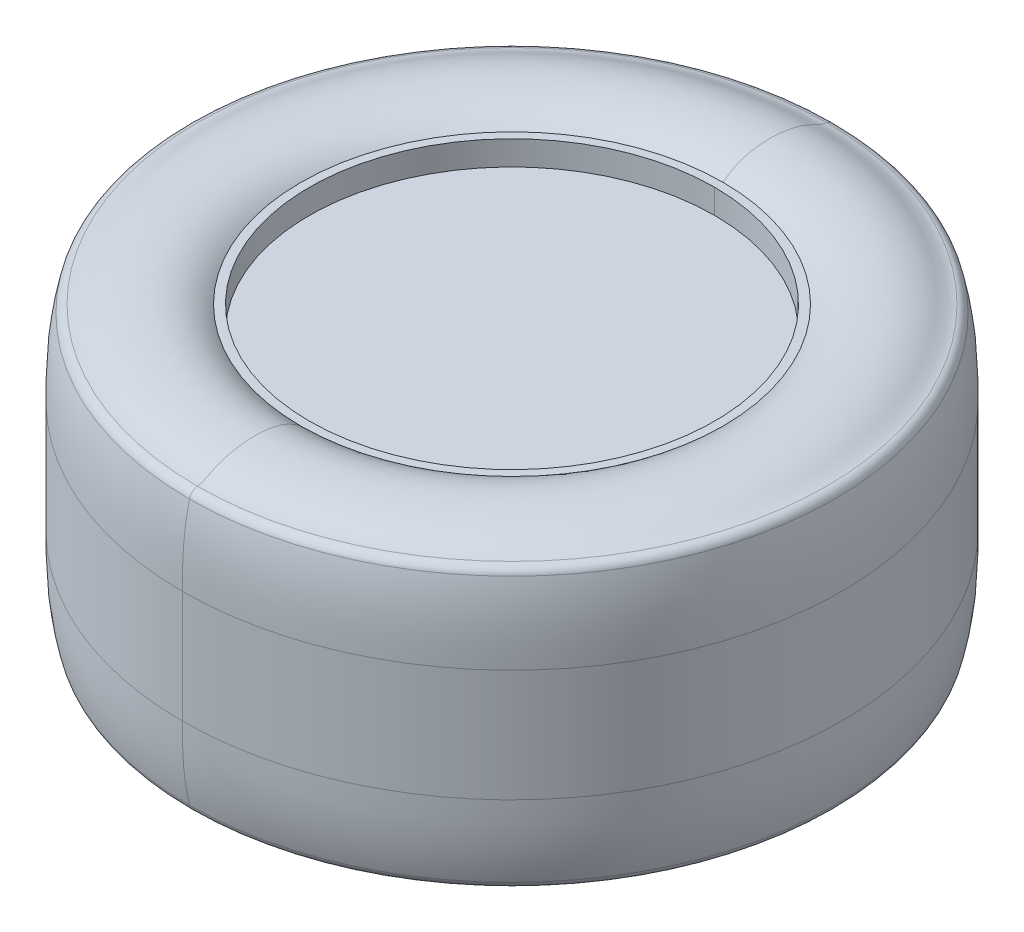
ISO-10303-21;
HEADER;
FILE_DESCRIPTION(('STEP AP214'),'2;1');
FILE_NAME('part.step','',(''),(''),'','','');
FILE_SCHEMA(('AUTOMOTIVE_DESIGN { 1 0 10303 214 1 1 1 1 }'));
ENDSEC;
DATA;
#1=APPLICATION_CONTEXT('core data for automotive mechanical design processes');
#2=APPLICATION_PROTOCOL_DEFINITION('international standard','automotive_design',2000,#1);
#3=PRODUCT_CONTEXT('',#1,'mechanical');
#4=PRODUCT('Part','Part','',(#3));
#5=PRODUCT_RELATED_PRODUCT_CATEGORY('part','',(#4));
#6=PRODUCT_DEFINITION_FORMATION('','',#4);
#7=PRODUCT_DEFINITION_CONTEXT('part definition',#1,'design');
#8=PRODUCT_DEFINITION('design','',#6,#7);
#9=PRODUCT_DEFINITION_SHAPE('','',#8);
#10=(LENGTH_UNIT() NAMED_UNIT(*) SI_UNIT(.MILLI.,.METRE.));
#11=(NAMED_UNIT(*) PLANE_ANGLE_UNIT() SI_UNIT($,.RADIAN.));
#12=(NAMED_UNIT(*) SI_UNIT($,.STERADIAN.) SOLID_ANGLE_UNIT());
#13=UNCERTAINTY_MEASURE_WITH_UNIT(LENGTH_MEASURE(1.E-05),#10,'distance_accuracy_value','');
#14=(GEOMETRIC_REPRESENTATION_CONTEXT(3) GLOBAL_UNCERTAINTY_ASSIGNED_CONTEXT((#13)) GLOBAL_UNIT_ASSIGNED_CONTEXT((#10,
#11,#12)) REPRESENTATION_CONTEXT('',''));
#15=CARTESIAN_POINT('',(0.,0.,0.));
#16=DIRECTION('',(0.,0.,1.));
#17=DIRECTION('',(1.,0.,0.));
#18=AXIS2_PLACEMENT_3D('',#15,#16,#17);
#19=CARTESIAN_POINT('',(0.,-790.,-50.));
#20=CARTESIAN_POINT('',(0.,-765.6190547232,-50.));
#21=CARTESIAN_POINT('',(0.,-741.2539641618,-50.));
#22=CARTESIAN_POINT('',(0.,-711.7224839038,-42.79019819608));
#23=(BOUNDED_CURVE() B_SPLINE_CURVE(3,(#19,#20,#21,#22),.UNSPECIFIED.,.F.,
.F.) B_SPLINE_CURVE_WITH_KNOTS((4,4),(0.,1.),
.UNSPECIFIED.) CURVE() GEOMETRIC_REPRESENTATION_ITEM() RATIONAL_B_SPLINE_CURVE((1.,1.,1.,1.)) REPRESENTATION_ITEM(''));
#24=CARTESIAN_POINT('',(0.,-790.,287.5));
#25=DIRECTION('',(0.,-1.,0.));
#26=AXIS1_PLACEMENT('',#24,#25);
#27=SURFACE_OF_REVOLUTION('',#23,#26);
#28=CARTESIAN_POINT('',(0.,-711.7224839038,-42.79019819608));
#29=CARTESIAN_POINT('',(0.,-741.2539641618,-50.));
#30=CARTESIAN_POINT('',(0.,-765.6190547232,-50.));
#31=CARTESIAN_POINT('',(0.,-790.,-50.));
#32=(BOUNDED_CURVE() B_SPLINE_CURVE(3,(#28,#29,#30,#31),.UNSPECIFIED.,.F.,
.F.) B_SPLINE_CURVE_WITH_KNOTS((4,4),(-1.,0.),
.UNSPECIFIED.) CURVE() GEOMETRIC_REPRESENTATION_ITEM() RATIONAL_B_SPLINE_CURVE((1.,1.,1.,1.)) REPRESENTATION_ITEM(''));
#33=CARTESIAN_POINT('',(0.,-711.7224839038,-42.79019819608));
#34=VERTEX_POINT('',#33);
#35=CARTESIAN_POINT('',(0.,-790.,-50.));
#36=VERTEX_POINT('',#35);
#37=EDGE_CURVE('E43',#34,#36,#32,.T.);
#38=ORIENTED_EDGE('',*,*,#37,.F.);
#39=CARTESIAN_POINT('',(0.,-711.7224839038,287.5));
#40=DIRECTION('',(0.,1.,0.));
#41=DIRECTION('',(0.,0.,-1.));
#42=AXIS2_PLACEMENT_3D('',#39,#40,#41);
#43=CIRCLE('',#42,330.29019819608);
#44=CARTESIAN_POINT('',(0.,-711.7224839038,617.79019819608));
#45=VERTEX_POINT('',#44);
#46=EDGE_CURVE('E158',#45,#34,#43,.T.);
#47=ORIENTED_EDGE('',*,*,#46,.F.);
#48=CARTESIAN_POINT('',(0.,-711.7224839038,617.79019819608));
#49=CARTESIAN_POINT('',(0.,-741.2539641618,625.));
#50=CARTESIAN_POINT('',(0.,-765.6190547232,625.));
#51=CARTESIAN_POINT('',(0.,-790.,625.));
#52=(BOUNDED_CURVE() B_SPLINE_CURVE(3,(#48,#49,#50,#51),.UNSPECIFIED.,.F.,
.F.) B_SPLINE_CURVE_WITH_KNOTS((4,4),(-1.,0.),
.UNSPECIFIED.) CURVE() GEOMETRIC_REPRESENTATION_ITEM() RATIONAL_B_SPLINE_CURVE((1.,1.,1.,1.)) REPRESENTATION_ITEM(''));
#53=CARTESIAN_POINT('',(0.,-790.,625.));
#54=VERTEX_POINT('',#53);
#55=EDGE_CURVE('E11',#45,#54,#52,.T.);
#56=ORIENTED_EDGE('',*,*,#55,.T.);
#57=CARTESIAN_POINT('',(0.,-790.,287.5));
#58=DIRECTION('',(0.,1.,0.));
#59=DIRECTION('',(0.,0.,-1.));
#60=AXIS2_PLACEMENT_3D('',#57,#58,#59);
#61=CIRCLE('',#60,337.5);
#62=EDGE_CURVE('E29',#54,#36,#61,.T.);
#63=ORIENTED_EDGE('',*,*,#62,.T.);
#64=EDGE_LOOP('',(#38,#47,#56,#63));
#65=FACE_BOUND('',#64,.T.);
#66=ADVANCED_FACE('F16',(#65),#27,.F.);
#67=CARTESIAN_POINT('',(0.,-704.2386406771,-34.76891355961));
#68=CARTESIAN_POINT('',(0.,-703.3635739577,-29.67599466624));
#69=CARTESIAN_POINT('',(0.,-700.9960068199,-23.94984631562));
#70=CARTESIAN_POINT('',(0.,-696.9334367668,-17.87878802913));
#71=CARTESIAN_POINT('',(0.,-691.2308892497,-8.378636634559));
#72=CARTESIAN_POINT('',(0.,-686.4900912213,10.766149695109));
#73=CARTESIAN_POINT('',(0.,-686.736889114,36.802176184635));
#74=CARTESIAN_POINT('',(0.,-693.463984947,58.611324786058));
#75=CARTESIAN_POINT('',(0.,-703.9999999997,71.320372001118));
#76=(BOUNDED_CURVE() B_SPLINE_CURVE(7,(#67,#68,#69,#70,#71,#72,#73,#74,#75),.UNSPECIFIED.,.F.,
.F.) B_SPLINE_CURVE_WITH_KNOTS((8,1,8),(0.,0.467340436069,1.),
.UNSPECIFIED.) CURVE() GEOMETRIC_REPRESENTATION_ITEM() RATIONAL_B_SPLINE_CURVE((1.,1.,1.,1.,1.,
1.,1.,1.,1.)) REPRESENTATION_ITEM(''));
#77=CARTESIAN_POINT('',(0.,-704.2386406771,287.5));
#78=DIRECTION('',(0.,-1.,0.));
#79=AXIS1_PLACEMENT('',#77,#78);
#80=SURFACE_OF_REVOLUTION('',#76,#79);
#81=CARTESIAN_POINT('',(0.,-703.9999999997,71.320372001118));
#82=CARTESIAN_POINT('',(0.,-693.463984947,58.611324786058));
#83=CARTESIAN_POINT('',(0.,-686.736889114,36.802176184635));
#84=CARTESIAN_POINT('',(0.,-686.4900912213,10.766149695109));
#85=CARTESIAN_POINT('',(0.,-691.2308892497,-8.378636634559));
#86=CARTESIAN_POINT('',(0.,-696.9334367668,-17.87878802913));
#87=CARTESIAN_POINT('',(0.,-700.9960068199,-23.94984631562));
#88=CARTESIAN_POINT('',(0.,-703.3635739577,-29.67599466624));
#89=CARTESIAN_POINT('',(0.,-704.2386406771,-34.76891355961));
#90=(BOUNDED_CURVE() B_SPLINE_CURVE(7,(#81,#82,#83,#84,#85,#86,#87,#88,#89),.UNSPECIFIED.,.F.,
.F.) B_SPLINE_CURVE_WITH_KNOTS((8,1,8),(-1.,-0.467340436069,0.),
.UNSPECIFIED.) CURVE() GEOMETRIC_REPRESENTATION_ITEM() RATIONAL_B_SPLINE_CURVE((1.,1.,1.,1.,1.,
1.,1.,1.,1.)) REPRESENTATION_ITEM(''));
#91=CARTESIAN_POINT('',(0.,-703.9999999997,71.32037200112));
#92=VERTEX_POINT('',#91);
#93=CARTESIAN_POINT('',(0.,-704.2386406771,-34.76891355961));
#94=VERTEX_POINT('',#93);
#95=EDGE_CURVE('E237',#92,#94,#90,.T.);
#96=ORIENTED_EDGE('',*,*,#95,.F.);
#97=CARTESIAN_POINT('',(0.,-703.9999999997,287.5));
#98=DIRECTION('',(0.,1.,0.));
#99=DIRECTION('',(0.,0.,-1.));
#100=AXIS2_PLACEMENT_3D('',#97,#98,#99);
#101=CIRCLE('',#100,216.17962799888);
#102=CARTESIAN_POINT('',(0.,-703.9999999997,503.679627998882));
#103=VERTEX_POINT('',#102);
#104=EDGE_CURVE('E246',#103,#92,#101,.T.);
#105=ORIENTED_EDGE('',*,*,#104,.F.);
#106=CARTESIAN_POINT('',(0.,-703.9999999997,503.679627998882));
#107=CARTESIAN_POINT('',(0.,-693.463984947,516.388675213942));
#108=CARTESIAN_POINT('',(0.,-686.736889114,538.197823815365));
#109=CARTESIAN_POINT('',(0.,-686.4900912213,564.233850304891));
#110=CARTESIAN_POINT('',(0.,-691.2308892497,583.378636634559));
#111=CARTESIAN_POINT('',(0.,-696.9334367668,592.87878802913));
#112=CARTESIAN_POINT('',(0.,-700.9960068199,598.94984631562));
#113=CARTESIAN_POINT('',(0.,-703.3635739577,604.67599466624));
#114=CARTESIAN_POINT('',(0.,-704.2386406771,609.76891355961));
#115=(BOUNDED_CURVE() B_SPLINE_CURVE(7,(#106,#107,#108,#109,#110,#111,#112,#113,#114),
.UNSPECIFIED.,.F.,.F.) B_SPLINE_CURVE_WITH_KNOTS((8,1,8),(-1.,-0.467340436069,0.),
.UNSPECIFIED.) CURVE() GEOMETRIC_REPRESENTATION_ITEM() RATIONAL_B_SPLINE_CURVE((1.,1.,1.,1.,1.,
1.,1.,1.,1.)) REPRESENTATION_ITEM(''));
#116=CARTESIAN_POINT('',(0.,-704.2386406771,609.76891355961));
#117=VERTEX_POINT('',#116);
#118=EDGE_CURVE('E217',#103,#117,#115,.T.);
#119=ORIENTED_EDGE('',*,*,#118,.T.);
#120=CARTESIAN_POINT('',(0.,-704.2386406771,287.5));
#121=DIRECTION('',(0.,1.,0.));
#122=DIRECTION('',(0.,0.,-1.));
#123=AXIS2_PLACEMENT_3D('',#120,#121,#122);
#124=CIRCLE('',#123,322.26891355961);
#125=EDGE_CURVE('E207',#117,#94,#124,.T.);
#126=ORIENTED_EDGE('',*,*,#125,.T.);
#127=EDGE_LOOP('',(#96,#105,#119,#126));
#128=FACE_BOUND('',#127,.T.);
#129=ADVANCED_FACE('F322',(#128),#80,.F.);
#130=CARTESIAN_POINT('',(0.,-905.,-50.));
#131=CARTESIAN_POINT('',(0.,-929.3809452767,-50.));
#132=CARTESIAN_POINT('',(0.,-953.7460358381,-50.));
#133=CARTESIAN_POINT('',(0.,-983.2775160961,-42.79019819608));
#134=(BOUNDED_CURVE() B_SPLINE_CURVE(3,(#130,#131,#132,#133),.UNSPECIFIED.,.F.,
.F.) B_SPLINE_CURVE_WITH_KNOTS((4,4),(0.,1.),
.UNSPECIFIED.) CURVE() GEOMETRIC_REPRESENTATION_ITEM() RATIONAL_B_SPLINE_CURVE((1.,1.,1.,1.)) REPRESENTATION_ITEM(''));
#135=CARTESIAN_POINT('',(0.,-905.,287.5));
#136=DIRECTION('',(0.,1.,0.));
#137=AXIS1_PLACEMENT('',#135,#136);
#138=SURFACE_OF_REVOLUTION('',#134,#137);
#139=CARTESIAN_POINT('',(0.,-983.2775160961,-42.79019819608));
#140=CARTESIAN_POINT('',(0.,-953.7460358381,-50.));
#141=CARTESIAN_POINT('',(0.,-929.3809452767,-50.));
#142=CARTESIAN_POINT('',(0.,-905.,-50.));
#143=(BOUNDED_CURVE() B_SPLINE_CURVE(3,(#139,#140,#141,#142),.UNSPECIFIED.,.F.,
.F.) B_SPLINE_CURVE_WITH_KNOTS((4,4),(-1.,0.),
.UNSPECIFIED.) CURVE() GEOMETRIC_REPRESENTATION_ITEM() RATIONAL_B_SPLINE_CURVE((1.,1.,1.,1.)) REPRESENTATION_ITEM(''));
#144=CARTESIAN_POINT('',(0.,-983.2775160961,-42.79019819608));
#145=VERTEX_POINT('',#144);
#146=CARTESIAN_POINT('',(0.,-905.,-50.));
#147=VERTEX_POINT('',#146);
#148=EDGE_CURVE('E254',#145,#147,#143,.T.);
#149=ORIENTED_EDGE('',*,*,#148,.F.);
#150=CARTESIAN_POINT('',(0.,-983.2775160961,287.5));
#151=DIRECTION('',(0.,-1.,0.));
#152=DIRECTION('',(0.,0.,-1.));
#153=AXIS2_PLACEMENT_3D('',#150,#151,#152);
#154=CIRCLE('',#153,330.29019819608);
#155=CARTESIAN_POINT('',(0.,-983.2775160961,617.79019819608));
#156=VERTEX_POINT('',#155);
#157=EDGE_CURVE('E196',#156,#145,#154,.T.);
#158=ORIENTED_EDGE('',*,*,#157,.F.);
#159=CARTESIAN_POINT('',(0.,-983.2775160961,617.79019819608));
#160=CARTESIAN_POINT('',(0.,-953.7460358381,625.));
#161=CARTESIAN_POINT('',(0.,-929.3809452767,625.));
#162=CARTESIAN_POINT('',(0.,-905.,625.));
#163=(BOUNDED_CURVE() B_SPLINE_CURVE(3,(#159,#160,#161,#162),.UNSPECIFIED.,.F.,
.F.) B_SPLINE_CURVE_WITH_KNOTS((4,4),(-1.,0.),
.UNSPECIFIED.) CURVE() GEOMETRIC_REPRESENTATION_ITEM() RATIONAL_B_SPLINE_CURVE((1.,1.,1.,1.)) REPRESENTATION_ITEM(''));
#164=CARTESIAN_POINT('',(0.,-905.,625.));
#165=VERTEX_POINT('',#164);
#166=EDGE_CURVE('E201',#156,#165,#163,.T.);
#167=ORIENTED_EDGE('',*,*,#166,.T.);
#168=CARTESIAN_POINT('',(0.,-905.,287.5));
#169=DIRECTION('',(0.,-1.,0.));
#170=DIRECTION('',(0.,0.,-1.));
#171=AXIS2_PLACEMENT_3D('',#168,#169,#170);
#172=CIRCLE('',#171,337.5);
#173=EDGE_CURVE('E167',#165,#147,#172,.T.);
#174=ORIENTED_EDGE('',*,*,#173,.T.);
#175=EDGE_LOOP('',(#149,#158,#167,#174));
#176=FACE_BOUND('',#175,.T.);
#177=ADVANCED_FACE('F327',(#176),#138,.F.);
#178=CARTESIAN_POINT('',(0.,-990.7613593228,-34.76891355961));
#179=CARTESIAN_POINT('',(0.,-991.6364260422,-29.67599466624));
#180=CARTESIAN_POINT('',(0.,-994.00399318,-23.94984631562));
#181=CARTESIAN_POINT('',(0.,-998.0665632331,-17.87878802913));
#182=CARTESIAN_POINT('',(0.,-1003.76911075,-8.378636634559));
#183=CARTESIAN_POINT('',(0.,-1008.509908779,10.766149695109));
#184=CARTESIAN_POINT('',(0.,-1008.263110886,36.802176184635));
#185=CARTESIAN_POINT('',(0.,-1001.536015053,58.611324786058));
#186=CARTESIAN_POINT('',(0.,-991.0000000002,71.320372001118));
#187=(BOUNDED_CURVE() B_SPLINE_CURVE(7,(#178,#179,#180,#181,#182,#183,#184,#185,#186),
.UNSPECIFIED.,.F.,.F.) B_SPLINE_CURVE_WITH_KNOTS((8,1,8),(0.,0.467340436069,1.),
.UNSPECIFIED.) CURVE() GEOMETRIC_REPRESENTATION_ITEM() RATIONAL_B_SPLINE_CURVE((1.,1.,1.,1.,1.,
1.,1.,1.,1.)) REPRESENTATION_ITEM(''));
#188=CARTESIAN_POINT('',(0.,-990.7613593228,287.5));
#189=DIRECTION('',(0.,1.,0.));
#190=AXIS1_PLACEMENT('',#188,#189);
#191=SURFACE_OF_REVOLUTION('',#187,#190);
#192=CARTESIAN_POINT('',(0.,-991.0000000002,71.320372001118));
#193=CARTESIAN_POINT('',(0.,-1001.536015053,58.611324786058));
#194=CARTESIAN_POINT('',(0.,-1008.263110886,36.802176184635));
#195=CARTESIAN_POINT('',(0.,-1008.509908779,10.766149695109));
#196=CARTESIAN_POINT('',(0.,-1003.76911075,-8.378636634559));
#197=CARTESIAN_POINT('',(0.,-998.0665632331,-17.87878802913));
#198=CARTESIAN_POINT('',(0.,-994.00399318,-23.94984631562));
#199=CARTESIAN_POINT('',(0.,-991.6364260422,-29.67599466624));
#200=CARTESIAN_POINT('',(0.,-990.7613593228,-34.76891355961));
#201=(BOUNDED_CURVE() B_SPLINE_CURVE(7,(#192,#193,#194,#195,#196,#197,#198,#199,#200),
.UNSPECIFIED.,.F.,.F.) B_SPLINE_CURVE_WITH_KNOTS((8,1,8),(-1.,-0.467340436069,0.),
.UNSPECIFIED.) CURVE() GEOMETRIC_REPRESENTATION_ITEM() RATIONAL_B_SPLINE_CURVE((1.,1.,1.,1.,1.,
1.,1.,1.,1.)) REPRESENTATION_ITEM(''));
#202=CARTESIAN_POINT('',(0.,-991.0000000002,71.32037200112));
#203=VERTEX_POINT('',#202);
#204=CARTESIAN_POINT('',(0.,-990.7613593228,-34.76891355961));
#205=VERTEX_POINT('',#204);
#206=EDGE_CURVE('E121',#203,#205,#201,.T.);
#207=ORIENTED_EDGE('',*,*,#206,.F.);
#208=CARTESIAN_POINT('',(0.,-991.0000000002,287.5));
#209=DIRECTION('',(0.,-1.,0.));
#210=DIRECTION('',(0.,0.,-1.));
#211=AXIS2_PLACEMENT_3D('',#208,#209,#210);
#212=CIRCLE('',#211,216.17962799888);
#213=CARTESIAN_POINT('',(0.,-991.0000000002,503.679627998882));
#214=VERTEX_POINT('',#213);
#215=EDGE_CURVE('E162',#214,#203,#212,.T.);
#216=ORIENTED_EDGE('',*,*,#215,.F.);
#217=CARTESIAN_POINT('',(0.,-991.0000000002,503.679627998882));
#218=CARTESIAN_POINT('',(0.,-1001.536015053,516.388675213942));
#219=CARTESIAN_POINT('',(0.,-1008.263110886,538.197823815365));
#220=CARTESIAN_POINT('',(0.,-1008.509908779,564.233850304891));
#221=CARTESIAN_POINT('',(0.,-1003.76911075,583.378636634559));
#222=CARTESIAN_POINT('',(0.,-998.0665632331,592.87878802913));
#223=CARTESIAN_POINT('',(0.,-994.00399318,598.94984631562));
#224=CARTESIAN_POINT('',(0.,-991.6364260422,604.67599466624));
#225=CARTESIAN_POINT('',(0.,-990.7613593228,609.76891355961));
#226=(BOUNDED_CURVE() B_SPLINE_CURVE(7,(#217,#218,#219,#220,#221,#222,#223,#224,#225),
.UNSPECIFIED.,.F.,.F.) B_SPLINE_CURVE_WITH_KNOTS((8,1,8),(-1.,-0.467340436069,0.),
.UNSPECIFIED.) CURVE() GEOMETRIC_REPRESENTATION_ITEM() RATIONAL_B_SPLINE_CURVE((1.,1.,1.,1.,1.,
1.,1.,1.,1.)) REPRESENTATION_ITEM(''));
#227=CARTESIAN_POINT('',(0.,-990.7613593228,609.76891355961));
#228=VERTEX_POINT('',#227);
#229=EDGE_CURVE('E157',#214,#228,#226,.T.);
#230=ORIENTED_EDGE('',*,*,#229,.T.);
#231=CARTESIAN_POINT('',(0.,-990.7613593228,287.5));
#232=DIRECTION('',(0.,-1.,0.));
#233=DIRECTION('',(0.,0.,-1.));
#234=AXIS2_PLACEMENT_3D('',#231,#232,#233);
#235=CIRCLE('',#234,322.26891355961);
#236=EDGE_CURVE('E153',#228,#205,#235,.T.);
#237=ORIENTED_EDGE('',*,*,#236,.T.);
#238=EDGE_LOOP('',(#207,#216,#230,#237));
#239=FACE_BOUND('',#238,.T.);
#240=ADVANCED_FACE('F161',(#239),#191,.F.);
#241=CARTESIAN_POINT('',(0.,-714.0942196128,287.5));
#242=DIRECTION('',(0.,1.,0.));
#243=DIRECTION('',(0.,0.,1.));
#244=AXIS2_PLACEMENT_3D('',#241,#242,#243);
#245=TOROIDAL_SURFACE('',#244,320.57552528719,10.);
#246=CARTESIAN_POINT('',(0.,-714.0942196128,608.07552528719));
#247=DIRECTION('',(-1.,0.,0.));
#248=DIRECTION('',(0.,0.,1.));
#249=AXIS2_PLACEMENT_3D('',#246,#247,#248);
#250=CIRCLE('',#249,10.);
#251=EDGE_CURVE('E228',#45,#117,#250,.T.);
#252=ORIENTED_EDGE('',*,*,#251,.F.);
#253=ORIENTED_EDGE('',*,*,#46,.T.);
#254=CARTESIAN_POINT('',(0.,-714.0942196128,-33.0755252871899));
#255=DIRECTION('',(-1.,0.,0.));
#256=DIRECTION('',(0.,0.,-1.));
#257=AXIS2_PLACEMENT_3D('',#254,#255,#256);
#258=CIRCLE('',#257,10.);
#259=EDGE_CURVE('E232',#94,#34,#258,.T.);
#260=ORIENTED_EDGE('',*,*,#259,.F.);
#261=ORIENTED_EDGE('',*,*,#125,.F.);
#262=EDGE_LOOP('',(#252,#253,#260,#261));
#263=FACE_BOUND('',#262,.T.);
#264=ADVANCED_FACE('F486',(#263),#245,.T.);
#265=CARTESIAN_POINT('',(0.,-738.6418141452,287.5));
#266=DIRECTION('',(0.,-1.,0.));
#267=DIRECTION('',(0.,0.,1.));
#268=AXIS2_PLACEMENT_3D('',#265,#266,#267);
#269=CYLINDRICAL_SURFACE('',#268,207.5);
#270=DIRECTION('',(0.,-1.,0.));
#271=VECTOR('',#270,1.);
#272=CARTESIAN_POINT('',(0.,-716.5,495.));
#273=LINE('',#272,#271);
#274=CARTESIAN_POINT('',(0.,-704.,495.));
#275=VERTEX_POINT('',#274);
#276=CARTESIAN_POINT('',(0.,-729.,495.));
#277=VERTEX_POINT('',#276);
#278=EDGE_CURVE('E184',#275,#277,#273,.T.);
#279=ORIENTED_EDGE('',*,*,#278,.F.);
#280=CARTESIAN_POINT('',(0.,-704.,287.5));
#281=DIRECTION('',(0.,1.,0.));
#282=DIRECTION('',(0.,0.,-1.));
#283=AXIS2_PLACEMENT_3D('',#280,#281,#282);
#284=CIRCLE('',#283,207.5);
#285=CARTESIAN_POINT('',(0.,-704.,80.));
#286=VERTEX_POINT('',#285);
#287=EDGE_CURVE('E199',#275,#286,#284,.T.);
#288=ORIENTED_EDGE('',*,*,#287,.T.);
#289=DIRECTION('',(0.,1.,0.));
#290=VECTOR('',#289,1.);
#291=CARTESIAN_POINT('',(0.,-716.5,80.));
#292=LINE('',#291,#290);
#293=CARTESIAN_POINT('',(0.,-729.,80.));
#294=VERTEX_POINT('',#293);
#295=EDGE_CURVE('E195',#294,#286,#292,.T.);
#296=ORIENTED_EDGE('',*,*,#295,.F.);
#297=CARTESIAN_POINT('',(0.,-729.,287.5));
#298=DIRECTION('',(0.,1.,0.));
#299=DIRECTION('',(0.,0.,-1.));
#300=AXIS2_PLACEMENT_3D('',#297,#298,#299);
#301=CIRCLE('',#300,207.5);
#302=EDGE_CURVE('E260',#277,#294,#301,.T.);
#303=ORIENTED_EDGE('',*,*,#302,.F.);
#304=EDGE_LOOP('',(#279,#288,#296,#303));
#305=FACE_BOUND('',#304,.T.);
#306=ADVANCED_FACE('F474',(#305),#269,.F.);
#307=CARTESIAN_POINT('',(0.,-956.3581858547,287.5));
#308=DIRECTION('',(0.,1.,0.));
#309=DIRECTION('',(0.,0.,1.));
#310=AXIS2_PLACEMENT_3D('',#307,#308,#309);
#311=CYLINDRICAL_SURFACE('',#310,337.5);
#312=DIRECTION('',(0.,-1.,0.));
#313=VECTOR('',#312,1.);
#314=CARTESIAN_POINT('',(0.,-847.5,625.));
#315=LINE('',#314,#313);
#316=EDGE_CURVE('E183',#54,#165,#315,.T.);
#317=ORIENTED_EDGE('',*,*,#316,.F.);
#318=CARTESIAN_POINT('',(0.,-790.,287.5));
#319=DIRECTION('',(0.,1.,0.));
#320=DIRECTION('',(0.,0.,-1.));
#321=AXIS2_PLACEMENT_3D('',#318,#319,#320);
#322=CIRCLE('',#321,337.5);
#323=EDGE_CURVE('E289',#36,#54,#322,.T.);
#324=ORIENTED_EDGE('',*,*,#323,.F.);
#325=DIRECTION('',(0.,1.,0.));
#326=VECTOR('',#325,1.);
#327=CARTESIAN_POINT('',(0.,-847.5,-50.));
#328=LINE('',#327,#326);
#329=EDGE_CURVE('E104',#147,#36,#328,.T.);
#330=ORIENTED_EDGE('',*,*,#329,.F.);
#331=ORIENTED_EDGE('',*,*,#173,.F.);
#332=EDGE_LOOP('',(#317,#324,#330,#331));
#333=FACE_BOUND('',#332,.T.);
#334=ADVANCED_FACE('F471',(#333),#311,.T.);
#335=CARTESIAN_POINT('',(0.,-980.9057803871,287.5));
#336=DIRECTION('',(0.,-1.,0.));
#337=DIRECTION('',(0.,0.,1.));
#338=AXIS2_PLACEMENT_3D('',#335,#336,#337);
#339=TOROIDAL_SURFACE('',#338,320.57552528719,10.);
#340=CARTESIAN_POINT('',(0.,-980.9057803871,608.07552528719));
#341=DIRECTION('',(1.,0.,0.));
#342=DIRECTION('',(0.,0.,1.));
#343=AXIS2_PLACEMENT_3D('',#340,#341,#342);
#344=CIRCLE('',#343,10.);
#345=EDGE_CURVE('E139',#156,#228,#344,.T.);
#346=ORIENTED_EDGE('',*,*,#345,.F.);
#347=ORIENTED_EDGE('',*,*,#157,.T.);
#348=CARTESIAN_POINT('',(0.,-980.9057803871,-33.0755252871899));
#349=DIRECTION('',(1.,0.,0.));
#350=DIRECTION('',(0.,0.,-1.));
#351=AXIS2_PLACEMENT_3D('',#348,#349,#350);
#352=CIRCLE('',#351,10.);
#353=EDGE_CURVE('E151',#205,#145,#352,.T.);
#354=ORIENTED_EDGE('',*,*,#353,.F.);
#355=ORIENTED_EDGE('',*,*,#236,.F.);
#356=EDGE_LOOP('',(#346,#347,#354,#355));
#357=FACE_BOUND('',#356,.T.);
#358=ADVANCED_FACE('F155',(#357),#339,.T.);
#359=CARTESIAN_POINT('',(0.,-956.3581858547,287.5));
#360=DIRECTION('',(0.,1.,0.));
#361=DIRECTION('',(0.,0.,1.));
#362=AXIS2_PLACEMENT_3D('',#359,#360,#361);
#363=CYLINDRICAL_SURFACE('',#362,207.5);
#364=DIRECTION('',(0.,1.,0.));
#365=VECTOR('',#364,1.);
#366=CARTESIAN_POINT('',(0.,-978.5,495.));
#367=LINE('',#366,#365);
#368=CARTESIAN_POINT('',(0.,-991.,495.));
#369=VERTEX_POINT('',#368);
#370=CARTESIAN_POINT('',(0.,-966.,495.));
#371=VERTEX_POINT('',#370);
#372=EDGE_CURVE('E188',#369,#371,#367,.T.);
#373=ORIENTED_EDGE('',*,*,#372,.F.);
#374=CARTESIAN_POINT('',(0.,-991.,287.5));
#375=DIRECTION('',(0.,-1.,0.));
#376=DIRECTION('',(0.,0.,-1.));
#377=AXIS2_PLACEMENT_3D('',#374,#375,#376);
#378=CIRCLE('',#377,207.5);
#379=CARTESIAN_POINT('',(0.,-991.,80.));
#380=VERTEX_POINT('',#379);
#381=EDGE_CURVE('E200',#369,#380,#378,.T.);
#382=ORIENTED_EDGE('',*,*,#381,.T.);
#383=DIRECTION('',(0.,-1.,0.));
#384=VECTOR('',#383,1.);
#385=CARTESIAN_POINT('',(0.,-978.5,80.));
#386=LINE('',#385,#384);
#387=CARTESIAN_POINT('',(0.,-966.,80.));
#388=VERTEX_POINT('',#387);
#389=EDGE_CURVE('E185',#388,#380,#386,.T.);
#390=ORIENTED_EDGE('',*,*,#389,.F.);
#391=CARTESIAN_POINT('',(0.,-966.,287.5));
#392=DIRECTION('',(0.,-1.,0.));
#393=DIRECTION('',(0.,0.,-1.));
#394=AXIS2_PLACEMENT_3D('',#391,#392,#393);
#395=CIRCLE('',#394,207.5);
#396=EDGE_CURVE('E192',#371,#388,#395,.T.);
#397=ORIENTED_EDGE('',*,*,#396,.F.);
#398=EDGE_LOOP('',(#373,#382,#390,#397));
#399=FACE_BOUND('',#398,.T.);
#400=ADVANCED_FACE('F441',(#399),#363,.F.);
#401=CARTESIAN_POINT('',(0.,-966.,287.5));
#402=DIRECTION('',(0.,-1.,0.));
#403=DIRECTION('',(0.,0.,1.));
#404=AXIS2_PLACEMENT_3D('',#401,#402,#403);
#405=CONICAL_SURFACE('',#404,202.5,0.872664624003);
#406=DIRECTION('',(0.,0.642787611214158,-0.766044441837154));
#407=VECTOR('',#406,1.);
#408=CARTESIAN_POINT('',(0.,-966.,490.));
#409=LINE('',#408,#407);
#410=CARTESIAN_POINT('',(0.,-966.,490.));
#411=VERTEX_POINT('',#410);
#412=CARTESIAN_POINT('',(0.,-956.3581858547,478.50933335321));
#413=VERTEX_POINT('',#412);
#414=EDGE_CURVE('E208',#411,#413,#409,.T.);
#415=ORIENTED_EDGE('',*,*,#414,.F.);
#416=CARTESIAN_POINT('',(0.,-966.,287.5));
#417=DIRECTION('',(0.,-1.,0.));
#418=DIRECTION('',(0.,0.,-1.));
#419=AXIS2_PLACEMENT_3D('',#416,#417,#418);
#420=CIRCLE('',#419,202.5);
#421=CARTESIAN_POINT('',(0.,-966.,85.));
#422=VERTEX_POINT('',#421);
#423=EDGE_CURVE('E274',#411,#422,#420,.T.);
#424=ORIENTED_EDGE('',*,*,#423,.T.);
#425=DIRECTION('',(0.,-0.642787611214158,-0.766044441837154));
#426=VECTOR('',#425,1.);
#427=CARTESIAN_POINT('',(0.,-966.,85.));
#428=LINE('',#427,#426);
#429=CARTESIAN_POINT('',(0.,-956.3581858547,96.49066664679));
#430=VERTEX_POINT('',#429);
#431=EDGE_CURVE('E216',#430,#422,#428,.T.);
#432=ORIENTED_EDGE('',*,*,#431,.F.);
#433=CARTESIAN_POINT('',(0.,-956.3581858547,287.5));
#434=DIRECTION('',(0.,-1.,0.));
#435=DIRECTION('',(0.,0.,-1.));
#436=AXIS2_PLACEMENT_3D('',#433,#434,#435);
#437=CIRCLE('',#436,191.00933335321);
#438=EDGE_CURVE('E215',#413,#430,#437,.T.);
#439=ORIENTED_EDGE('',*,*,#438,.F.);
#440=EDGE_LOOP('',(#415,#424,#432,#439));
#441=FACE_BOUND('',#440,.T.);
#442=ADVANCED_FACE('F477',(#441),#405,.F.);
#443=CARTESIAN_POINT('',(0.,-729.,287.5));
#444=DIRECTION('',(0.,-1.,0.));
#445=DIRECTION('',(0.,0.,-1.));
#446=AXIS2_PLACEMENT_3D('',#443,#444,#445);
#447=PLANE('',#446);
#448=CARTESIAN_POINT('',(0.,-729.,287.5));
#449=DIRECTION('',(0.,1.,0.));
#450=DIRECTION('',(0.,0.,-1.));
#451=AXIS2_PLACEMENT_3D('',#448,#449,#450);
#452=CIRCLE('',#451,207.5);
#453=EDGE_CURVE('E267',#294,#277,#452,.T.);
#454=ORIENTED_EDGE('',*,*,#453,.T.);
#455=ORIENTED_EDGE('',*,*,#302,.T.);
#456=EDGE_LOOP('',(#454,#455));
#457=FACE_BOUND('',#456,.T.);
#458=ADVANCED_FACE('F481',(#457),#447,.F.);
#459=CARTESIAN_POINT('',(0.,-956.3581858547,96.490666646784));
#460=DIRECTION('',(0.,1.,0.));
#461=DIRECTION('',(1.,0.,0.));
#462=AXIS2_PLACEMENT_3D('',#459,#460,#461);
#463=PLANE('',#462);
#464=CARTESIAN_POINT('',(0.,-956.3581858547,287.5));
#465=DIRECTION('',(0.,-1.,0.));
#466=DIRECTION('',(0.,0.,-1.));
#467=AXIS2_PLACEMENT_3D('',#464,#465,#466);
#468=CIRCLE('',#467,191.00933335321);
#469=EDGE_CURVE('E268',#430,#413,#468,.T.);
#470=ORIENTED_EDGE('',*,*,#469,.T.);
#471=ORIENTED_EDGE('',*,*,#438,.T.);
#472=EDGE_LOOP('',(#470,#471));
#473=FACE_BOUND('',#472,.T.);
#474=ADVANCED_FACE('F478',(#473),#463,.F.);
#475=CARTESIAN_POINT('',(0.,-966.,287.5));
#476=DIRECTION('',(0.,-1.,0.));
#477=DIRECTION('',(0.,0.,1.));
#478=AXIS2_PLACEMENT_3D('',#475,#476,#477);
#479=CONICAL_SURFACE('',#478,202.5,0.872664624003);
#480=ORIENTED_EDGE('',*,*,#414,.T.);
#481=ORIENTED_EDGE('',*,*,#469,.F.);
#482=ORIENTED_EDGE('',*,*,#431,.T.);
#483=CARTESIAN_POINT('',(0.,-966.,287.5));
#484=DIRECTION('',(0.,-1.,0.));
#485=DIRECTION('',(0.,0.,-1.));
#486=AXIS2_PLACEMENT_3D('',#483,#484,#485);
#487=CIRCLE('',#486,202.5);
#488=EDGE_CURVE('E269',#422,#411,#487,.T.);
#489=ORIENTED_EDGE('',*,*,#488,.T.);
#490=EDGE_LOOP('',(#480,#481,#482,#489));
#491=FACE_BOUND('',#490,.T.);
#492=ADVANCED_FACE('F469',(#491),#479,.F.);
#493=CARTESIAN_POINT('',(0.,-966.,80.));
#494=DIRECTION('',(0.,1.,0.));
#495=DIRECTION('',(1.,0.,0.));
#496=AXIS2_PLACEMENT_3D('',#493,#494,#495);
#497=PLANE('',#496);
#498=CARTESIAN_POINT('',(0.,-966.,287.5));
#499=DIRECTION('',(0.,-1.,0.));
#500=DIRECTION('',(0.,0.,-1.));
#501=AXIS2_PLACEMENT_3D('',#498,#499,#500);
#502=CIRCLE('',#501,207.5);
#503=EDGE_CURVE('E273',#388,#371,#502,.T.);
#504=ORIENTED_EDGE('',*,*,#503,.T.);
#505=ORIENTED_EDGE('',*,*,#396,.T.);
#506=EDGE_LOOP('',(#504,#505));
#507=FACE_BOUND('',#506,.T.);
#508=ORIENTED_EDGE('',*,*,#488,.F.);
#509=ORIENTED_EDGE('',*,*,#423,.F.);
#510=EDGE_LOOP('',(#508,#509));
#511=FACE_BOUND('',#510,.T.);
#512=ADVANCED_FACE('F464',(#507,#511),#497,.F.);
#513=CARTESIAN_POINT('',(0.,-956.3581858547,287.5));
#514=DIRECTION('',(0.,1.,0.));
#515=DIRECTION('',(0.,0.,1.));
#516=AXIS2_PLACEMENT_3D('',#513,#514,#515);
#517=CYLINDRICAL_SURFACE('',#516,207.5);
#518=ORIENTED_EDGE('',*,*,#372,.T.);
#519=ORIENTED_EDGE('',*,*,#503,.F.);
#520=ORIENTED_EDGE('',*,*,#389,.T.);
#521=CARTESIAN_POINT('',(0.,-991.,287.5));
#522=DIRECTION('',(0.,-1.,0.));
#523=DIRECTION('',(0.,0.,-1.));
#524=AXIS2_PLACEMENT_3D('',#521,#522,#523);
#525=CIRCLE('',#524,207.5);
#526=EDGE_CURVE('E189',#380,#369,#525,.T.);
#527=ORIENTED_EDGE('',*,*,#526,.T.);
#528=EDGE_LOOP('',(#518,#519,#520,#527));
#529=FACE_BOUND('',#528,.T.);
#530=ADVANCED_FACE('F459',(#529),#517,.F.);
#531=CARTESIAN_POINT('',(0.,-991.0000000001,71.3203720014));
#532=DIRECTION('',(0.,1.,0.));
#533=DIRECTION('',(1.,0.,0.));
#534=AXIS2_PLACEMENT_3D('',#531,#532,#533);
#535=PLANE('',#534);
#536=CARTESIAN_POINT('',(0.,-991.0000000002,287.5));
#537=DIRECTION('',(0.,-1.,0.));
#538=DIRECTION('',(0.,0.,-1.));
#539=AXIS2_PLACEMENT_3D('',#536,#537,#538);
#540=CIRCLE('',#539,216.17962799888);
#541=EDGE_CURVE('E180',#203,#214,#540,.T.);
#542=ORIENTED_EDGE('',*,*,#541,.T.);
#543=ORIENTED_EDGE('',*,*,#215,.T.);
#544=EDGE_LOOP('',(#542,#543));
#545=FACE_BOUND('',#544,.T.);
#546=ORIENTED_EDGE('',*,*,#526,.F.);
#547=ORIENTED_EDGE('',*,*,#381,.F.);
#548=EDGE_LOOP('',(#546,#547));
#549=FACE_BOUND('',#548,.T.);
#550=ADVANCED_FACE('F359',(#545,#549),#535,.F.);
#551=CARTESIAN_POINT('',(0.,-990.7613593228,-34.76891355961));
#552=CARTESIAN_POINT('',(0.,-991.6364260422,-29.67599466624));
#553=CARTESIAN_POINT('',(0.,-994.00399318,-23.94984631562));
#554=CARTESIAN_POINT('',(0.,-998.0665632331,-17.87878802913));
#555=CARTESIAN_POINT('',(0.,-1003.76911075,-8.378636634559));
#556=CARTESIAN_POINT('',(0.,-1008.509908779,10.766149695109));
#557=CARTESIAN_POINT('',(0.,-1008.263110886,36.802176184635));
#558=CARTESIAN_POINT('',(0.,-1001.536015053,58.611324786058));
#559=CARTESIAN_POINT('',(0.,-991.0000000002,71.320372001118));
#560=(BOUNDED_CURVE() B_SPLINE_CURVE(7,(#551,#552,#553,#554,#555,#556,#557,#558,#559),
.UNSPECIFIED.,.F.,.F.) B_SPLINE_CURVE_WITH_KNOTS((8,1,8),(0.,0.467340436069,1.),
.UNSPECIFIED.) CURVE() GEOMETRIC_REPRESENTATION_ITEM() RATIONAL_B_SPLINE_CURVE((1.,1.,1.,1.,1.,
1.,1.,1.,1.)) REPRESENTATION_ITEM(''));
#561=CARTESIAN_POINT('',(0.,-990.7613593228,287.5));
#562=DIRECTION('',(0.,1.,0.));
#563=AXIS1_PLACEMENT('',#561,#562);
#564=SURFACE_OF_REVOLUTION('',#560,#563);
#565=ORIENTED_EDGE('',*,*,#206,.T.);
#566=CARTESIAN_POINT('',(0.,-990.7613593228,287.5));
#567=DIRECTION('',(0.,-1.,0.));
#568=DIRECTION('',(0.,0.,-1.));
#569=AXIS2_PLACEMENT_3D('',#566,#567,#568);
#570=CIRCLE('',#569,322.26891355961);
#571=EDGE_CURVE('E144',#205,#228,#570,.T.);
#572=ORIENTED_EDGE('',*,*,#571,.T.);
#573=ORIENTED_EDGE('',*,*,#229,.F.);
#574=ORIENTED_EDGE('',*,*,#541,.F.);
#575=EDGE_LOOP('',(#565,#572,#573,#574));
#576=FACE_BOUND('',#575,.T.);
#577=ADVANCED_FACE('F169',(#576),#564,.F.);
#578=CARTESIAN_POINT('',(0.,-980.9057803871,287.5));
#579=DIRECTION('',(0.,-1.,0.));
#580=DIRECTION('',(0.,0.,1.));
#581=AXIS2_PLACEMENT_3D('',#578,#579,#580);
#582=TOROIDAL_SURFACE('',#581,320.57552528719,10.);
#583=ORIENTED_EDGE('',*,*,#345,.T.);
#584=ORIENTED_EDGE('',*,*,#571,.F.);
#585=ORIENTED_EDGE('',*,*,#353,.T.);
#586=CARTESIAN_POINT('',(0.,-983.2775160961,287.5));
#587=DIRECTION('',(0.,-1.,0.));
#588=DIRECTION('',(0.,0.,-1.));
#589=AXIS2_PLACEMENT_3D('',#586,#587,#588);
#590=CIRCLE('',#589,330.29019819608);
#591=EDGE_CURVE('E146',#145,#156,#590,.T.);
#592=ORIENTED_EDGE('',*,*,#591,.T.);
#593=EDGE_LOOP('',(#583,#584,#585,#592));
#594=FACE_BOUND('',#593,.T.);
#595=ADVANCED_FACE('F141',(#594),#582,.T.);
#596=CARTESIAN_POINT('',(0.,-905.,-50.));
#597=CARTESIAN_POINT('',(0.,-929.3809452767,-50.));
#598=CARTESIAN_POINT('',(0.,-953.7460358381,-50.));
#599=CARTESIAN_POINT('',(0.,-983.2775160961,-42.79019819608));
#600=(BOUNDED_CURVE() B_SPLINE_CURVE(3,(#596,#597,#598,#599),.UNSPECIFIED.,.F.,
.F.) B_SPLINE_CURVE_WITH_KNOTS((4,4),(0.,1.),
.UNSPECIFIED.) CURVE() GEOMETRIC_REPRESENTATION_ITEM() RATIONAL_B_SPLINE_CURVE((1.,1.,1.,1.)) REPRESENTATION_ITEM(''));
#601=CARTESIAN_POINT('',(0.,-905.,287.5));
#602=DIRECTION('',(0.,1.,0.));
#603=AXIS1_PLACEMENT('',#601,#602);
#604=SURFACE_OF_REVOLUTION('',#600,#603);
#605=ORIENTED_EDGE('',*,*,#148,.T.);
#606=CARTESIAN_POINT('',(0.,-905.,287.5));
#607=DIRECTION('',(0.,-1.,0.));
#608=DIRECTION('',(0.,0.,-1.));
#609=AXIS2_PLACEMENT_3D('',#606,#607,#608);
#610=CIRCLE('',#609,337.5);
#611=EDGE_CURVE('E259',#147,#165,#610,.T.);
#612=ORIENTED_EDGE('',*,*,#611,.T.);
#613=ORIENTED_EDGE('',*,*,#166,.F.);
#614=ORIENTED_EDGE('',*,*,#591,.F.);
#615=EDGE_LOOP('',(#605,#612,#613,#614));
#616=FACE_BOUND('',#615,.T.);
#617=ADVANCED_FACE('F360',(#616),#604,.F.);
#618=CARTESIAN_POINT('',(0.,-956.3581858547,287.5));
#619=DIRECTION('',(0.,1.,0.));
#620=DIRECTION('',(0.,0.,1.));
#621=AXIS2_PLACEMENT_3D('',#618,#619,#620);
#622=CYLINDRICAL_SURFACE('',#621,337.5);
#623=ORIENTED_EDGE('',*,*,#316,.T.);
#624=ORIENTED_EDGE('',*,*,#611,.F.);
#625=ORIENTED_EDGE('',*,*,#329,.T.);
#626=ORIENTED_EDGE('',*,*,#62,.F.);
#627=EDGE_LOOP('',(#623,#624,#625,#626));
#628=FACE_BOUND('',#627,.T.);
#629=ADVANCED_FACE('F362',(#628),#622,.T.);
#630=CARTESIAN_POINT('',(0.,-738.6418141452,287.5));
#631=DIRECTION('',(0.,-1.,0.));
#632=DIRECTION('',(0.,0.,1.));
#633=AXIS2_PLACEMENT_3D('',#630,#631,#632);
#634=CYLINDRICAL_SURFACE('',#633,207.5);
#635=ORIENTED_EDGE('',*,*,#278,.T.);
#636=ORIENTED_EDGE('',*,*,#453,.F.);
#637=ORIENTED_EDGE('',*,*,#295,.T.);
#638=CARTESIAN_POINT('',(0.,-704.,287.5));
#639=DIRECTION('',(0.,1.,0.));
#640=DIRECTION('',(0.,0.,-1.));
#641=AXIS2_PLACEMENT_3D('',#638,#639,#640);
#642=CIRCLE('',#641,207.5);
#643=EDGE_CURVE('E281',#286,#275,#642,.T.);
#644=ORIENTED_EDGE('',*,*,#643,.T.);
#645=EDGE_LOOP('',(#635,#636,#637,#644));
#646=FACE_BOUND('',#645,.T.);
#647=ADVANCED_FACE('F381',(#646),#634,.F.);
#648=CARTESIAN_POINT('',(0.,-703.9999999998,71.3203720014));
#649=DIRECTION('',(0.,-1.,0.));
#650=DIRECTION('',(0.,0.,-1.));
#651=AXIS2_PLACEMENT_3D('',#648,#649,#650);
#652=PLANE('',#651);
#653=CARTESIAN_POINT('',(0.,-703.9999999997,287.5));
#654=DIRECTION('',(0.,1.,0.));
#655=DIRECTION('',(0.,0.,-1.));
#656=AXIS2_PLACEMENT_3D('',#653,#654,#655);
#657=CIRCLE('',#656,216.17962799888);
#658=EDGE_CURVE('E253',#92,#103,#657,.T.);
#659=ORIENTED_EDGE('',*,*,#658,.T.);
#660=ORIENTED_EDGE('',*,*,#104,.T.);
#661=EDGE_LOOP('',(#659,#660));
#662=FACE_BOUND('',#661,.T.);
#663=ORIENTED_EDGE('',*,*,#643,.F.);
#664=ORIENTED_EDGE('',*,*,#287,.F.);
#665=EDGE_LOOP('',(#663,#664));
#666=FACE_BOUND('',#665,.T.);
#667=ADVANCED_FACE('F323',(#662,#666),#652,.F.);
#668=CARTESIAN_POINT('',(0.,-704.2386406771,-34.76891355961));
#669=CARTESIAN_POINT('',(0.,-703.3635739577,-29.67599466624));
#670=CARTESIAN_POINT('',(0.,-700.9960068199,-23.94984631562));
#671=CARTESIAN_POINT('',(0.,-696.9334367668,-17.87878802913));
#672=CARTESIAN_POINT('',(0.,-691.2308892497,-8.378636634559));
#673=CARTESIAN_POINT('',(0.,-686.4900912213,10.766149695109));
#674=CARTESIAN_POINT('',(0.,-686.736889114,36.802176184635));
#675=CARTESIAN_POINT('',(0.,-693.463984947,58.611324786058));
#676=CARTESIAN_POINT('',(0.,-703.9999999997,71.320372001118));
#677=(BOUNDED_CURVE() B_SPLINE_CURVE(7,(#668,#669,#670,#671,#672,#673,#674,#675,#676),
.UNSPECIFIED.,.F.,.F.) B_SPLINE_CURVE_WITH_KNOTS((8,1,8),(0.,0.467340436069,1.),
.UNSPECIFIED.) CURVE() GEOMETRIC_REPRESENTATION_ITEM() RATIONAL_B_SPLINE_CURVE((1.,1.,1.,1.,1.,
1.,1.,1.,1.)) REPRESENTATION_ITEM(''));
#678=CARTESIAN_POINT('',(0.,-704.2386406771,287.5));
#679=DIRECTION('',(0.,-1.,0.));
#680=AXIS1_PLACEMENT('',#678,#679);
#681=SURFACE_OF_REVOLUTION('',#677,#680);
#682=ORIENTED_EDGE('',*,*,#95,.T.);
#683=CARTESIAN_POINT('',(0.,-704.2386406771,287.5));
#684=DIRECTION('',(0.,1.,0.));
#685=DIRECTION('',(0.,0.,-1.));
#686=AXIS2_PLACEMENT_3D('',#683,#684,#685);
#687=CIRCLE('',#686,322.26891355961);
#688=EDGE_CURVE('E231',#94,#117,#687,.T.);
#689=ORIENTED_EDGE('',*,*,#688,.T.);
#690=ORIENTED_EDGE('',*,*,#118,.F.);
#691=ORIENTED_EDGE('',*,*,#658,.F.);
#692=EDGE_LOOP('',(#682,#689,#690,#691));
#693=FACE_BOUND('',#692,.T.);
#694=ADVANCED_FACE('F364',(#693),#681,.F.);
#695=CARTESIAN_POINT('',(0.,-714.0942196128,287.5));
#696=DIRECTION('',(0.,1.,0.));
#697=DIRECTION('',(0.,0.,1.));
#698=AXIS2_PLACEMENT_3D('',#695,#696,#697);
#699=TOROIDAL_SURFACE('',#698,320.57552528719,10.);
#700=ORIENTED_EDGE('',*,*,#251,.T.);
#701=ORIENTED_EDGE('',*,*,#688,.F.);
#702=ORIENTED_EDGE('',*,*,#259,.T.);
#703=CARTESIAN_POINT('',(0.,-711.7224839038,287.5));
#704=DIRECTION('',(0.,1.,0.));
#705=DIRECTION('',(0.,0.,-1.));
#706=AXIS2_PLACEMENT_3D('',#703,#704,#705);
#707=CIRCLE('',#706,330.29019819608);
#708=EDGE_CURVE('E288',#34,#45,#707,.T.);
#709=ORIENTED_EDGE('',*,*,#708,.T.);
#710=EDGE_LOOP('',(#700,#701,#702,#709));
#711=FACE_BOUND('',#710,.T.);
#712=ADVANCED_FACE('F366',(#711),#699,.T.);
#713=CARTESIAN_POINT('',(0.,-790.,-50.));
#714=CARTESIAN_POINT('',(0.,-765.6190547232,-50.));
#715=CARTESIAN_POINT('',(0.,-741.2539641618,-50.));
#716=CARTESIAN_POINT('',(0.,-711.7224839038,-42.79019819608));
#717=(BOUNDED_CURVE() B_SPLINE_CURVE(3,(#713,#714,#715,#716),.UNSPECIFIED.,.F.,
.F.) B_SPLINE_CURVE_WITH_KNOTS((4,4),(0.,1.),
.UNSPECIFIED.) CURVE() GEOMETRIC_REPRESENTATION_ITEM() RATIONAL_B_SPLINE_CURVE((1.,1.,1.,1.)) REPRESENTATION_ITEM(''));
#718=CARTESIAN_POINT('',(0.,-790.,287.5));
#719=DIRECTION('',(0.,-1.,0.));
#720=AXIS1_PLACEMENT('',#718,#719);
#721=SURFACE_OF_REVOLUTION('',#717,#720);
#722=ORIENTED_EDGE('',*,*,#37,.T.);
#723=ORIENTED_EDGE('',*,*,#323,.T.);
#724=ORIENTED_EDGE('',*,*,#55,.F.);
#725=ORIENTED_EDGE('',*,*,#708,.F.);
#726=EDGE_LOOP('',(#722,#723,#724,#725));
#727=FACE_BOUND('',#726,.T.);
#728=ADVANCED_FACE('F18',(#727),#721,.F.);
#729=CLOSED_SHELL('',(#66,#129,#177,#240,#264,#306,#334,#358,#400,#442,#458,#474,#492,#512,#530,
#550,#577,#595,#617,#629,#647,#667,#694,#712,#728));
#730=MANIFOLD_SOLID_BREP('B1',#729);
#731=ADVANCED_BREP_SHAPE_REPRESENTATION('',(#18,#730),#14);
#732=SHAPE_DEFINITION_REPRESENTATION(#9,#731);
ENDSEC;
END-ISO-10303-21;
